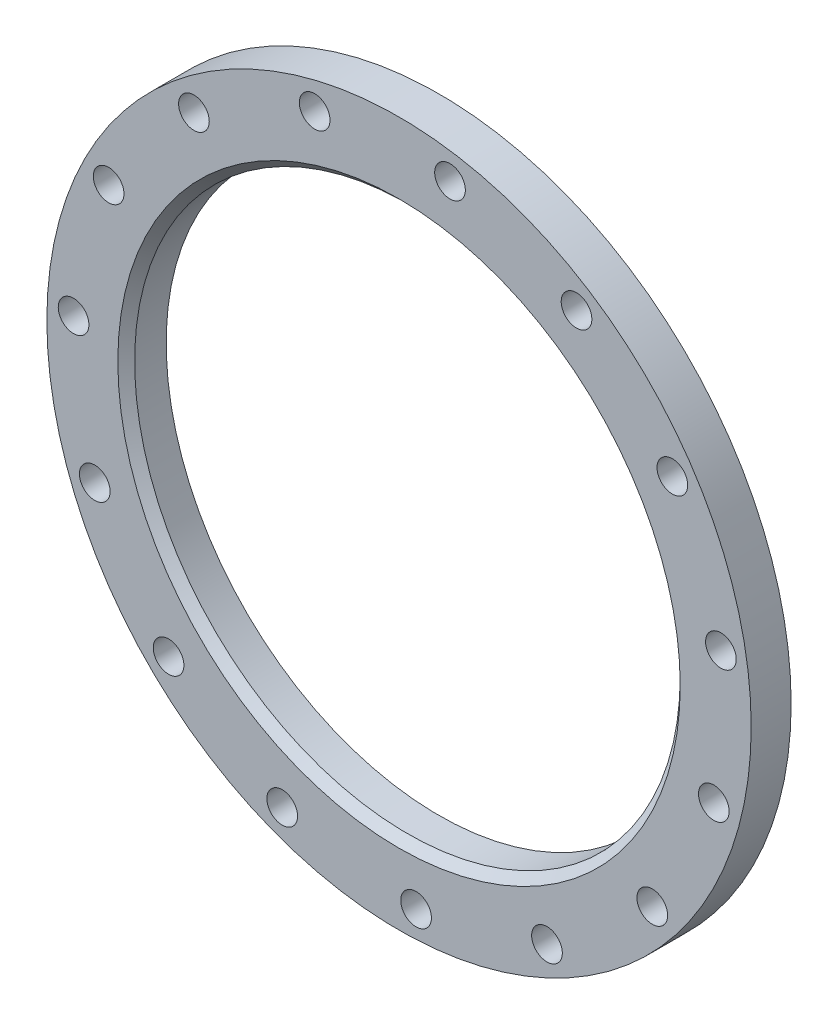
ISO-10303-21;
HEADER;
FILE_DESCRIPTION(('STEP AP214'),'2;1');
FILE_NAME('part.step','',(''),(''),'','','');
FILE_SCHEMA(('AUTOMOTIVE_DESIGN { 1 0 10303 214 1 1 1 1 }'));
ENDSEC;
DATA;
#1=APPLICATION_CONTEXT('core data for automotive mechanical design processes');
#2=APPLICATION_PROTOCOL_DEFINITION('international standard','automotive_design',2000,#1);
#3=PRODUCT_CONTEXT('',#1,'mechanical');
#4=PRODUCT('Part','Part','',(#3));
#5=PRODUCT_RELATED_PRODUCT_CATEGORY('part','',(#4));
#6=PRODUCT_DEFINITION_FORMATION('','',#4);
#7=PRODUCT_DEFINITION_CONTEXT('part definition',#1,'design');
#8=PRODUCT_DEFINITION('design','',#6,#7);
#9=PRODUCT_DEFINITION_SHAPE('','',#8);
#10=(LENGTH_UNIT() NAMED_UNIT(*) SI_UNIT(.MILLI.,.METRE.));
#11=(NAMED_UNIT(*) PLANE_ANGLE_UNIT() SI_UNIT($,.RADIAN.));
#12=(NAMED_UNIT(*) SI_UNIT($,.STERADIAN.) SOLID_ANGLE_UNIT());
#13=UNCERTAINTY_MEASURE_WITH_UNIT(LENGTH_MEASURE(1.E-05),#10,'distance_accuracy_value','');
#14=(GEOMETRIC_REPRESENTATION_CONTEXT(3) GLOBAL_UNCERTAINTY_ASSIGNED_CONTEXT((#13)) GLOBAL_UNIT_ASSIGNED_CONTEXT((#10,
#11,#12)) REPRESENTATION_CONTEXT('',''));
#15=CARTESIAN_POINT('',(0.,0.,0.));
#16=DIRECTION('',(0.,0.,1.));
#17=DIRECTION('',(1.,0.,0.));
#18=AXIS2_PLACEMENT_3D('',#15,#16,#17);
#19=CARTESIAN_POINT('',(0.,0.,38.));
#20=DIRECTION('',(0.,0.,1.));
#21=DIRECTION('',(1.,0.,0.));
#22=AXIS2_PLACEMENT_3D('',#19,#20,#21);
#23=PLANE('',#22);
#24=CARTESIAN_POINT('',(-80.2339039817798,299.437006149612,38.));
#25=DIRECTION('',(0.,0.,1.));
#26=DIRECTION('',(0.913545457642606,0.406736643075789,0.));
#27=AXIS2_PLACEMENT_3D('',#24,#25,#26);
#28=CIRCLE('',#27,14.587474);
#29=CARTESIAN_POINT('',(-66.9075833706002,305.370266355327,38.));
#30=VERTEX_POINT('',#29);
#31=EDGE_CURVE('E153',#30,#30,#28,.T.);
#32=ORIENTED_EDGE('',*,*,#31,.F.);
#33=EDGE_LOOP('',(#32));
#34=FACE_BOUND('',#33,.T.);
#35=CARTESIAN_POINT('',(-195.089321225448,240.915248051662,38.));
#36=DIRECTION('',(0.,0.,1.));
#37=DIRECTION('',(0.669130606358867,0.743144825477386,0.));
#38=AXIS2_PLACEMENT_3D('',#35,#36,#37);
#39=CIRCLE('',#38,14.587474);
#40=CARTESIAN_POINT('',(-185.328395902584,251.755853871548,38.));
#41=VERTEX_POINT('',#40);
#42=EDGE_CURVE('E150',#41,#41,#39,.T.);
#43=ORIENTED_EDGE('',*,*,#42,.F.);
#44=EDGE_LOOP('',(#43));
#45=FACE_BOUND('',#44,.T.);
#46=CARTESIAN_POINT('',(-276.212022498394,140.737054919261,38.));
#47=DIRECTION('',(0.,0.,1.));
#48=DIRECTION('',(0.309016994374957,0.95105651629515,0.));
#49=AXIS2_PLACEMENT_3D('',#46,#47,#48);
#50=CIRCLE('',#49,14.587474);
#51=CARTESIAN_POINT('',(-271.704245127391,154.610567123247,38.));
#52=VERTEX_POINT('',#51);
#53=EDGE_CURVE('E143',#52,#52,#50,.T.);
#54=ORIENTED_EDGE('',*,*,#53,.F.);
#55=EDGE_LOOP('',(#54));
#56=FACE_BOUND('',#55,.T.);
#57=CARTESIAN_POINT('',(-309.575155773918,16.2241464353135,38.));
#58=DIRECTION('',(0.,0.,1.));
#59=DIRECTION('',(-0.104528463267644,0.994521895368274,0.));
#60=AXIS2_PLACEMENT_3D('',#57,#58,#59);
#61=CIRCLE('',#60,14.587474);
#62=CARTESIAN_POINT('',(-311.099962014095,30.7317087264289,38.));
#63=VERTEX_POINT('',#62);
#64=EDGE_CURVE('E132',#63,#63,#61,.T.);
#65=ORIENTED_EDGE('',*,*,#64,.F.);
#66=EDGE_LOOP('',(#65));
#67=FACE_BOUND('',#66,.T.);
#68=CARTESIAN_POINT('',(-289.409932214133,-111.094064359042,38.));
#69=DIRECTION('',(0.,0.,1.));
#70=DIRECTION('',(-0.499999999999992,0.866025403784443,0.));
#71=AXIS2_PLACEMENT_3D('',#68,#69,#70);
#72=CIRCLE('',#71,14.587474);
#73=CARTESIAN_POINT('',(-296.703669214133,-98.4609412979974,38.));
#74=VERTEX_POINT('',#73);
#75=EDGE_CURVE('E129',#74,#74,#72,.T.);
#76=ORIENTED_EDGE('',*,*,#75,.F.);
#77=EDGE_LOOP('',(#76));
#78=FACE_BOUND('',#77,.T.);
#79=CARTESIAN_POINT('',(-219.20310216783,-219.20310216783,38.));
#80=DIRECTION('',(0.,0.,1.));
#81=DIRECTION('',(-0.809016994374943,0.58778525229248,0.));
#82=AXIS2_PLACEMENT_3D('',#79,#80,#81);
#83=CIRCLE('',#82,14.587474);
#84=CARTESIAN_POINT('',(-231.004616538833,-210.62880008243,38.));
#85=VERTEX_POINT('',#84);
#86=EDGE_CURVE('E122',#85,#85,#83,.T.);
#87=ORIENTED_EDGE('',*,*,#86,.F.);
#88=EDGE_LOOP('',(#87));
#89=FACE_BOUND('',#88,.T.);
#90=CARTESIAN_POINT('',(-111.094064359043,-289.409932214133,38.));
#91=DIRECTION('',(0.,0.,1.));
#92=DIRECTION('',(-0.978147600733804,0.207911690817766,0.));
#93=AXIS2_PLACEMENT_3D('',#90,#91,#92);
#94=CIRCLE('',#93,14.587474);
#95=CARTESIAN_POINT('',(-125.36276705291,-286.377025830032,38.));
#96=VERTEX_POINT('',#95);
#97=EDGE_CURVE('E119',#96,#96,#94,.T.);
#98=ORIENTED_EDGE('',*,*,#97,.F.);
#99=EDGE_LOOP('',(#98));
#100=FACE_BOUND('',#99,.T.);
#101=CARTESIAN_POINT('',(16.2241464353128,-309.575155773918,38.));
#102=DIRECTION('',(0.,0.,1.));
#103=DIRECTION('',(-0.978147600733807,-0.207911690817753,0.));
#104=AXIS2_PLACEMENT_3D('',#101,#102,#103);
#105=CIRCLE('',#104,14.587474);
#106=CARTESIAN_POINT('',(1.95544374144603,-312.608062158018,38.));
#107=VERTEX_POINT('',#106);
#108=EDGE_CURVE('E112',#107,#107,#105,.T.);
#109=ORIENTED_EDGE('',*,*,#108,.F.);
#110=EDGE_LOOP('',(#109));
#111=FACE_BOUND('',#110,.T.);
#112=CARTESIAN_POINT('',(140.73705491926,-276.212022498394,38.));
#113=DIRECTION('',(0.,0.,1.));
#114=DIRECTION('',(-0.80901699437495,-0.587785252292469,0.));
#115=AXIS2_PLACEMENT_3D('',#112,#113,#114);
#116=CIRCLE('',#115,14.587474);
#117=CARTESIAN_POINT('',(128.935540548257,-284.786324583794,38.));
#118=VERTEX_POINT('',#117);
#119=EDGE_CURVE('E104',#118,#118,#116,.T.);
#120=ORIENTED_EDGE('',*,*,#119,.F.);
#121=EDGE_LOOP('',(#120));
#122=FACE_BOUND('',#121,.T.);
#123=CARTESIAN_POINT('',(240.915248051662,-195.089321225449,38.));
#124=DIRECTION('',(0.,0.,1.));
#125=DIRECTION('',(-0.500000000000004,-0.866025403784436,0.));
#126=AXIS2_PLACEMENT_3D('',#123,#124,#125);
#127=CIRCLE('',#126,14.587474);
#128=CARTESIAN_POINT('',(233.621511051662,-207.722444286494,38.));
#129=VERTEX_POINT('',#128);
#130=EDGE_CURVE('E97',#129,#129,#127,.T.);
#131=ORIENTED_EDGE('',*,*,#130,.F.);
#132=EDGE_LOOP('',(#131));
#133=FACE_BOUND('',#132,.T.);
#134=CARTESIAN_POINT('',(299.437006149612,-80.2339039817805,38.));
#135=DIRECTION('',(0.,0.,1.));
#136=DIRECTION('',(-0.104528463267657,-0.994521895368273,0.));
#137=AXIS2_PLACEMENT_3D('',#134,#135,#136);
#138=CIRCLE('',#137,14.587474);
#139=CARTESIAN_POINT('',(297.912199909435,-94.7414662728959,38.));
#140=VERTEX_POINT('',#139);
#141=EDGE_CURVE('E91',#140,#140,#138,.T.);
#142=ORIENTED_EDGE('',*,*,#141,.F.);
#143=EDGE_LOOP('',(#142));
#144=FACE_BOUND('',#143,.T.);
#145=CARTESIAN_POINT('',(306.183385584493,48.4946841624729,38.));
#146=DIRECTION('',(0.,0.,1.));
#147=DIRECTION('',(0.309016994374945,-0.951056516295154,0.));
#148=AXIS2_PLACEMENT_3D('',#145,#146,#147);
#149=CIRCLE('',#148,14.587474);
#150=CARTESIAN_POINT('',(310.691162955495,34.6211719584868,38.));
#151=VERTEX_POINT('',#150);
#152=EDGE_CURVE('E87',#151,#151,#149,.T.);
#153=ORIENTED_EDGE('',*,*,#152,.F.);
#154=EDGE_LOOP('',(#153));
#155=FACE_BOUND('',#154,.T.);
#156=CARTESIAN_POINT('',(259.987876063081,168.83810085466,38.));
#157=DIRECTION('',(0.,0.,1.));
#158=DIRECTION('',(0.669130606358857,-0.743144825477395,0.));
#159=AXIS2_PLACEMENT_3D('',#156,#157,#158);
#160=CIRCLE('',#159,14.587474);
#161=CARTESIAN_POINT('',(269.748801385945,157.997495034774,38.));
#162=VERTEX_POINT('',#161);
#163=EDGE_CURVE('E81',#162,#162,#160,.T.);
#164=ORIENTED_EDGE('',*,*,#163,.F.);
#165=EDGE_LOOP('',(#164));
#166=FACE_BOUND('',#165,.T.);
#167=CARTESIAN_POINT('',(168.838100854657,259.987876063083,38.));
#168=DIRECTION('',(0.,0.,1.));
#169=DIRECTION('',(0.913545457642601,-0.406736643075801,0.));
#170=AXIS2_PLACEMENT_3D('',#167,#168,#169);
#171=CIRCLE('',#170,14.587474);
#172=CARTESIAN_POINT('',(182.164421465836,254.054615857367,38.));
#173=VERTEX_POINT('',#172);
#174=EDGE_CURVE('E73',#173,#173,#171,.T.);
#175=ORIENTED_EDGE('',*,*,#174,.F.);
#176=EDGE_LOOP('',(#175));
#177=FACE_BOUND('',#176,.T.);
#178=CARTESIAN_POINT('',(48.4946841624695,306.183385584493,38.));
#179=DIRECTION('',(0.,0.,1.));
#180=DIRECTION('',(1.,0.,0.));
#181=AXIS2_PLACEMENT_3D('',#178,#179,#180);
#182=CIRCLE('',#181,14.587474);
#183=CARTESIAN_POINT('',(63.0821581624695,306.183385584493,38.));
#184=VERTEX_POINT('',#183);
#185=EDGE_CURVE('E70',#184,#184,#182,.T.);
#186=ORIENTED_EDGE('',*,*,#185,.F.);
#187=EDGE_LOOP('',(#186));
#188=FACE_BOUND('',#187,.T.);
#189=CARTESIAN_POINT('',(0.,0.,38.));
#190=DIRECTION('',(0.,0.,1.));
#191=DIRECTION('',(1.,0.,0.));
#192=AXIS2_PLACEMENT_3D('',#189,#190,#191);
#193=CIRCLE('',#192,267.500000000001);
#194=CARTESIAN_POINT('',(267.500000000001,0.,38.));
#195=VERTEX_POINT('',#194);
#196=EDGE_CURVE('E10',#195,#195,#193,.F.);
#197=ORIENTED_EDGE('',*,*,#196,.T.);
#198=EDGE_LOOP('',(#197));
#199=FACE_BOUND('',#198,.T.);
#200=CARTESIAN_POINT('',(0.,0.,38.));
#201=DIRECTION('',(0.,0.,1.));
#202=DIRECTION('',(1.,0.,0.));
#203=AXIS2_PLACEMENT_3D('',#200,#201,#202);
#204=CIRCLE('',#203,335.);
#205=CARTESIAN_POINT('',(335.,0.,38.));
#206=VERTEX_POINT('',#205);
#207=EDGE_CURVE('E57',#206,#206,#204,.T.);
#208=ORIENTED_EDGE('',*,*,#207,.T.);
#209=EDGE_LOOP('',(#208));
#210=FACE_BOUND('',#209,.T.);
#211=ADVANCED_FACE('F44',(#34,#45,#56,#67,#78,#89,#100,#111,#122,#133,#144,#155,#166,#177,#188,
#199,#210),#23,.T.);
#212=CARTESIAN_POINT('',(0.,0.,0.));
#213=DIRECTION('',(0.,0.,1.));
#214=DIRECTION('',(1.,0.,0.));
#215=AXIS2_PLACEMENT_3D('',#212,#213,#214);
#216=PLANE('',#215);
#217=CARTESIAN_POINT('',(-80.2339039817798,299.437006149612,0.));
#218=DIRECTION('',(0.,0.,1.));
#219=DIRECTION('',(0.913545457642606,0.406736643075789,0.));
#220=AXIS2_PLACEMENT_3D('',#217,#218,#219);
#221=CIRCLE('',#220,14.587474);
#222=CARTESIAN_POINT('',(-66.9075833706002,305.370266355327,0.));
#223=VERTEX_POINT('',#222);
#224=EDGE_CURVE('E147',#223,#223,#221,.T.);
#225=ORIENTED_EDGE('',*,*,#224,.T.);
#226=EDGE_LOOP('',(#225));
#227=FACE_BOUND('',#226,.T.);
#228=CARTESIAN_POINT('',(-195.089321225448,240.915248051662,0.));
#229=DIRECTION('',(0.,0.,1.));
#230=DIRECTION('',(0.669130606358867,0.743144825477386,0.));
#231=AXIS2_PLACEMENT_3D('',#228,#229,#230);
#232=CIRCLE('',#231,14.587474);
#233=CARTESIAN_POINT('',(-185.328395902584,251.755853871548,0.));
#234=VERTEX_POINT('',#233);
#235=EDGE_CURVE('E145',#234,#234,#232,.T.);
#236=ORIENTED_EDGE('',*,*,#235,.T.);
#237=EDGE_LOOP('',(#236));
#238=FACE_BOUND('',#237,.T.);
#239=CARTESIAN_POINT('',(-276.212022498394,140.737054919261,0.));
#240=DIRECTION('',(0.,0.,1.));
#241=DIRECTION('',(0.309016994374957,0.95105651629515,0.));
#242=AXIS2_PLACEMENT_3D('',#239,#240,#241);
#243=CIRCLE('',#242,14.587474);
#244=CARTESIAN_POINT('',(-271.704245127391,154.610567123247,0.));
#245=VERTEX_POINT('',#244);
#246=EDGE_CURVE('E138',#245,#245,#243,.T.);
#247=ORIENTED_EDGE('',*,*,#246,.T.);
#248=EDGE_LOOP('',(#247));
#249=FACE_BOUND('',#248,.T.);
#250=CARTESIAN_POINT('',(-309.575155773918,16.2241464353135,0.));
#251=DIRECTION('',(0.,0.,1.));
#252=DIRECTION('',(-0.104528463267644,0.994521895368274,0.));
#253=AXIS2_PLACEMENT_3D('',#250,#251,#252);
#254=CIRCLE('',#253,14.587474);
#255=CARTESIAN_POINT('',(-311.099962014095,30.7317087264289,0.));
#256=VERTEX_POINT('',#255);
#257=EDGE_CURVE('E135',#256,#256,#254,.T.);
#258=ORIENTED_EDGE('',*,*,#257,.T.);
#259=EDGE_LOOP('',(#258));
#260=FACE_BOUND('',#259,.T.);
#261=CARTESIAN_POINT('',(-289.409932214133,-111.094064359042,0.));
#262=DIRECTION('',(0.,0.,1.));
#263=DIRECTION('',(-0.499999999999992,0.866025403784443,0.));
#264=AXIS2_PLACEMENT_3D('',#261,#262,#263);
#265=CIRCLE('',#264,14.587474);
#266=CARTESIAN_POINT('',(-296.703669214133,-98.4609412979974,0.));
#267=VERTEX_POINT('',#266);
#268=EDGE_CURVE('E127',#267,#267,#265,.T.);
#269=ORIENTED_EDGE('',*,*,#268,.T.);
#270=EDGE_LOOP('',(#269));
#271=FACE_BOUND('',#270,.T.);
#272=CARTESIAN_POINT('',(-219.20310216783,-219.20310216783,0.));
#273=DIRECTION('',(0.,0.,1.));
#274=DIRECTION('',(-0.809016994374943,0.58778525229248,0.));
#275=AXIS2_PLACEMENT_3D('',#272,#273,#274);
#276=CIRCLE('',#275,14.587474);
#277=CARTESIAN_POINT('',(-231.004616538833,-210.62880008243,0.));
#278=VERTEX_POINT('',#277);
#279=EDGE_CURVE('E118',#278,#278,#276,.T.);
#280=ORIENTED_EDGE('',*,*,#279,.T.);
#281=EDGE_LOOP('',(#280));
#282=FACE_BOUND('',#281,.T.);
#283=CARTESIAN_POINT('',(-111.094064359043,-289.409932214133,0.));
#284=DIRECTION('',(0.,0.,1.));
#285=DIRECTION('',(-0.978147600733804,0.207911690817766,0.));
#286=AXIS2_PLACEMENT_3D('',#283,#284,#285);
#287=CIRCLE('',#286,14.587474);
#288=CARTESIAN_POINT('',(-125.36276705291,-286.377025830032,0.));
#289=VERTEX_POINT('',#288);
#290=EDGE_CURVE('E111',#289,#289,#287,.T.);
#291=ORIENTED_EDGE('',*,*,#290,.T.);
#292=EDGE_LOOP('',(#291));
#293=FACE_BOUND('',#292,.T.);
#294=CARTESIAN_POINT('',(16.2241464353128,-309.575155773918,0.));
#295=DIRECTION('',(0.,0.,1.));
#296=DIRECTION('',(-0.978147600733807,-0.207911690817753,0.));
#297=AXIS2_PLACEMENT_3D('',#294,#295,#296);
#298=CIRCLE('',#297,14.587474);
#299=CARTESIAN_POINT('',(1.95544374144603,-312.608062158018,0.));
#300=VERTEX_POINT('',#299);
#301=EDGE_CURVE('E107',#300,#300,#298,.T.);
#302=ORIENTED_EDGE('',*,*,#301,.T.);
#303=EDGE_LOOP('',(#302));
#304=FACE_BOUND('',#303,.T.);
#305=CARTESIAN_POINT('',(140.73705491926,-276.212022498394,0.));
#306=DIRECTION('',(0.,0.,1.));
#307=DIRECTION('',(-0.80901699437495,-0.587785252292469,0.));
#308=AXIS2_PLACEMENT_3D('',#305,#306,#307);
#309=CIRCLE('',#308,14.587474);
#310=CARTESIAN_POINT('',(128.935540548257,-284.786324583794,0.));
#311=VERTEX_POINT('',#310);
#312=EDGE_CURVE('E105',#311,#311,#309,.T.);
#313=ORIENTED_EDGE('',*,*,#312,.T.);
#314=EDGE_LOOP('',(#313));
#315=FACE_BOUND('',#314,.T.);
#316=CARTESIAN_POINT('',(240.915248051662,-195.089321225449,0.));
#317=DIRECTION('',(0.,0.,1.));
#318=DIRECTION('',(-0.500000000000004,-0.866025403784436,0.));
#319=AXIS2_PLACEMENT_3D('',#316,#317,#318);
#320=CIRCLE('',#319,14.587474);
#321=CARTESIAN_POINT('',(233.621511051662,-207.722444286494,0.));
#322=VERTEX_POINT('',#321);
#323=EDGE_CURVE('E96',#322,#322,#320,.T.);
#324=ORIENTED_EDGE('',*,*,#323,.T.);
#325=EDGE_LOOP('',(#324));
#326=FACE_BOUND('',#325,.T.);
#327=CARTESIAN_POINT('',(299.437006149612,-80.2339039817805,0.));
#328=DIRECTION('',(0.,0.,1.));
#329=DIRECTION('',(-0.104528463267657,-0.994521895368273,0.));
#330=AXIS2_PLACEMENT_3D('',#327,#328,#329);
#331=CIRCLE('',#330,14.587474);
#332=CARTESIAN_POINT('',(297.912199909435,-94.7414662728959,0.));
#333=VERTEX_POINT('',#332);
#334=EDGE_CURVE('E89',#333,#333,#331,.T.);
#335=ORIENTED_EDGE('',*,*,#334,.T.);
#336=EDGE_LOOP('',(#335));
#337=FACE_BOUND('',#336,.T.);
#338=CARTESIAN_POINT('',(306.183385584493,48.4946841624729,0.));
#339=DIRECTION('',(0.,0.,1.));
#340=DIRECTION('',(0.309016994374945,-0.951056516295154,0.));
#341=AXIS2_PLACEMENT_3D('',#338,#339,#340);
#342=CIRCLE('',#341,14.587474);
#343=CARTESIAN_POINT('',(310.691162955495,34.6211719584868,0.));
#344=VERTEX_POINT('',#343);
#345=EDGE_CURVE('E82',#344,#344,#342,.T.);
#346=ORIENTED_EDGE('',*,*,#345,.T.);
#347=EDGE_LOOP('',(#346));
#348=FACE_BOUND('',#347,.T.);
#349=CARTESIAN_POINT('',(259.987876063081,168.83810085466,0.));
#350=DIRECTION('',(0.,0.,1.));
#351=DIRECTION('',(0.669130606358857,-0.743144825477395,0.));
#352=AXIS2_PLACEMENT_3D('',#349,#350,#351);
#353=CIRCLE('',#352,14.587474);
#354=CARTESIAN_POINT('',(269.748801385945,157.997495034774,0.));
#355=VERTEX_POINT('',#354);
#356=EDGE_CURVE('E76',#355,#355,#353,.T.);
#357=ORIENTED_EDGE('',*,*,#356,.T.);
#358=EDGE_LOOP('',(#357));
#359=FACE_BOUND('',#358,.T.);
#360=CARTESIAN_POINT('',(168.838100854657,259.987876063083,0.));
#361=DIRECTION('',(0.,0.,1.));
#362=DIRECTION('',(0.913545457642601,-0.406736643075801,0.));
#363=AXIS2_PLACEMENT_3D('',#360,#361,#362);
#364=CIRCLE('',#363,14.587474);
#365=CARTESIAN_POINT('',(182.164421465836,254.054615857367,0.));
#366=VERTEX_POINT('',#365);
#367=EDGE_CURVE('E75',#366,#366,#364,.T.);
#368=ORIENTED_EDGE('',*,*,#367,.T.);
#369=EDGE_LOOP('',(#368));
#370=FACE_BOUND('',#369,.T.);
#371=CARTESIAN_POINT('',(48.4946841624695,306.183385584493,0.));
#372=DIRECTION('',(0.,0.,1.));
#373=DIRECTION('',(1.,0.,0.));
#374=AXIS2_PLACEMENT_3D('',#371,#372,#373);
#375=CIRCLE('',#374,14.587474);
#376=CARTESIAN_POINT('',(63.0821581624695,306.183385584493,0.));
#377=VERTEX_POINT('',#376);
#378=EDGE_CURVE('E67',#377,#377,#375,.T.);
#379=ORIENTED_EDGE('',*,*,#378,.T.);
#380=EDGE_LOOP('',(#379));
#381=FACE_BOUND('',#380,.T.);
#382=CARTESIAN_POINT('',(0.,0.,0.));
#383=DIRECTION('',(0.,0.,1.));
#384=DIRECTION('',(1.,0.,0.));
#385=AXIS2_PLACEMENT_3D('',#382,#383,#384);
#386=CIRCLE('',#385,335.);
#387=CARTESIAN_POINT('',(335.,0.,0.));
#388=VERTEX_POINT('',#387);
#389=EDGE_CURVE('E58',#388,#388,#386,.T.);
#390=ORIENTED_EDGE('',*,*,#389,.F.);
#391=EDGE_LOOP('',(#390));
#392=FACE_BOUND('',#391,.T.);
#393=CARTESIAN_POINT('',(0.,0.,0.));
#394=DIRECTION('',(0.,0.,1.));
#395=DIRECTION('',(1.,0.,0.));
#396=AXIS2_PLACEMENT_3D('',#393,#394,#395);
#397=CIRCLE('',#396,259.5);
#398=CARTESIAN_POINT('',(259.5,0.,0.));
#399=VERTEX_POINT('',#398);
#400=EDGE_CURVE('E61',#399,#399,#397,.T.);
#401=ORIENTED_EDGE('',*,*,#400,.T.);
#402=EDGE_LOOP('',(#401));
#403=FACE_BOUND('',#402,.T.);
#404=ADVANCED_FACE('F157',(#227,#238,#249,#260,#271,#282,#293,#304,#315,#326,#337,#348,#359,
#370,#381,#392,#403),#216,.F.);
#405=CARTESIAN_POINT('',(0.,0.,38.));
#406=DIRECTION('',(0.,0.,-1.));
#407=DIRECTION('',(-1.,0.,0.));
#408=AXIS2_PLACEMENT_3D('',#405,#406,#407);
#409=CYLINDRICAL_SURFACE('',#408,335.);
#410=ORIENTED_EDGE('',*,*,#207,.F.);
#411=EDGE_LOOP('',(#410));
#412=FACE_BOUND('',#411,.T.);
#413=ORIENTED_EDGE('',*,*,#389,.T.);
#414=EDGE_LOOP('',(#413));
#415=FACE_BOUND('',#414,.T.);
#416=ADVANCED_FACE('F205',(#412,#415),#409,.T.);
#417=CARTESIAN_POINT('',(0.,0.,38.));
#418=DIRECTION('',(0.,0.,-1.));
#419=DIRECTION('',(-1.,0.,0.));
#420=AXIS2_PLACEMENT_3D('',#417,#418,#419);
#421=CYLINDRICAL_SURFACE('',#420,259.5);
#422=CARTESIAN_POINT('',(0.,0.,29.9999999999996));
#423=DIRECTION('',(0.,0.,1.));
#424=DIRECTION('',(1.,0.,0.));
#425=AXIS2_PLACEMENT_3D('',#422,#423,#424);
#426=CIRCLE('',#425,259.5);
#427=CARTESIAN_POINT('',(259.5,0.,29.9999999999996));
#428=VERTEX_POINT('',#427);
#429=EDGE_CURVE('E55',#428,#428,#426,.T.);
#430=ORIENTED_EDGE('',*,*,#429,.T.);
#431=EDGE_LOOP('',(#430));
#432=FACE_BOUND('',#431,.T.);
#433=ORIENTED_EDGE('',*,*,#400,.F.);
#434=EDGE_LOOP('',(#433));
#435=FACE_BOUND('',#434,.T.);
#436=ADVANCED_FACE('F202',(#432,#435),#421,.F.);
#437=CARTESIAN_POINT('',(0.,0.,29.9999999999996));
#438=DIRECTION('',(0.,0.,1.));
#439=DIRECTION('',(1.,0.,0.));
#440=AXIS2_PLACEMENT_3D('',#437,#438,#439);
#441=CONICAL_SURFACE('',#440,259.5,0.785398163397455);
#442=ORIENTED_EDGE('',*,*,#196,.F.);
#443=EDGE_LOOP('',(#442));
#444=FACE_BOUND('',#443,.T.);
#445=ORIENTED_EDGE('',*,*,#429,.F.);
#446=EDGE_LOOP('',(#445));
#447=FACE_BOUND('',#446,.T.);
#448=ADVANCED_FACE('F50',(#444,#447),#441,.F.);
#449=CARTESIAN_POINT('',(48.4946841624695,306.183385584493,0.));
#450=DIRECTION('',(0.,0.,1.));
#451=DIRECTION('',(1.,0.,0.));
#452=AXIS2_PLACEMENT_3D('',#449,#450,#451);
#453=CYLINDRICAL_SURFACE('',#452,14.587474);
#454=ORIENTED_EDGE('',*,*,#378,.F.);
#455=EDGE_LOOP('',(#454));
#456=FACE_BOUND('',#455,.T.);
#457=ORIENTED_EDGE('',*,*,#185,.T.);
#458=EDGE_LOOP('',(#457));
#459=FACE_BOUND('',#458,.T.);
#460=ADVANCED_FACE('F217',(#456,#459),#453,.F.);
#461=CARTESIAN_POINT('',(168.838100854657,259.987876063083,0.));
#462=DIRECTION('',(0.,0.,1.));
#463=DIRECTION('',(1.,0.,0.));
#464=AXIS2_PLACEMENT_3D('',#461,#462,#463);
#465=CYLINDRICAL_SURFACE('',#464,14.587474);
#466=ORIENTED_EDGE('',*,*,#367,.F.);
#467=EDGE_LOOP('',(#466));
#468=FACE_BOUND('',#467,.T.);
#469=ORIENTED_EDGE('',*,*,#174,.T.);
#470=EDGE_LOOP('',(#469));
#471=FACE_BOUND('',#470,.T.);
#472=ADVANCED_FACE('F224',(#468,#471),#465,.F.);
#473=CARTESIAN_POINT('',(259.987876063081,168.83810085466,0.));
#474=DIRECTION('',(0.,0.,1.));
#475=DIRECTION('',(1.,0.,0.));
#476=AXIS2_PLACEMENT_3D('',#473,#474,#475);
#477=CYLINDRICAL_SURFACE('',#476,14.587474);
#478=ORIENTED_EDGE('',*,*,#356,.F.);
#479=EDGE_LOOP('',(#478));
#480=FACE_BOUND('',#479,.T.);
#481=ORIENTED_EDGE('',*,*,#163,.T.);
#482=EDGE_LOOP('',(#481));
#483=FACE_BOUND('',#482,.T.);
#484=ADVANCED_FACE('F229',(#480,#483),#477,.F.);
#485=CARTESIAN_POINT('',(306.183385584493,48.4946841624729,0.));
#486=DIRECTION('',(0.,0.,1.));
#487=DIRECTION('',(1.,0.,0.));
#488=AXIS2_PLACEMENT_3D('',#485,#486,#487);
#489=CYLINDRICAL_SURFACE('',#488,14.587474);
#490=ORIENTED_EDGE('',*,*,#345,.F.);
#491=EDGE_LOOP('',(#490));
#492=FACE_BOUND('',#491,.T.);
#493=ORIENTED_EDGE('',*,*,#152,.T.);
#494=EDGE_LOOP('',(#493));
#495=FACE_BOUND('',#494,.T.);
#496=ADVANCED_FACE('F233',(#492,#495),#489,.F.);
#497=CARTESIAN_POINT('',(299.437006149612,-80.2339039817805,0.));
#498=DIRECTION('',(0.,0.,1.));
#499=DIRECTION('',(1.,0.,0.));
#500=AXIS2_PLACEMENT_3D('',#497,#498,#499);
#501=CYLINDRICAL_SURFACE('',#500,14.587474);
#502=ORIENTED_EDGE('',*,*,#334,.F.);
#503=EDGE_LOOP('',(#502));
#504=FACE_BOUND('',#503,.T.);
#505=ORIENTED_EDGE('',*,*,#141,.T.);
#506=EDGE_LOOP('',(#505));
#507=FACE_BOUND('',#506,.T.);
#508=ADVANCED_FACE('F231',(#504,#507),#501,.F.);
#509=CARTESIAN_POINT('',(240.915248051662,-195.089321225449,0.));
#510=DIRECTION('',(0.,0.,1.));
#511=DIRECTION('',(1.,0.,0.));
#512=AXIS2_PLACEMENT_3D('',#509,#510,#511);
#513=CYLINDRICAL_SURFACE('',#512,14.587474);
#514=ORIENTED_EDGE('',*,*,#323,.F.);
#515=EDGE_LOOP('',(#514));
#516=FACE_BOUND('',#515,.T.);
#517=ORIENTED_EDGE('',*,*,#130,.T.);
#518=EDGE_LOOP('',(#517));
#519=FACE_BOUND('',#518,.T.);
#520=ADVANCED_FACE('F239',(#516,#519),#513,.F.);
#521=CARTESIAN_POINT('',(140.73705491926,-276.212022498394,0.));
#522=DIRECTION('',(0.,0.,1.));
#523=DIRECTION('',(1.,0.,0.));
#524=AXIS2_PLACEMENT_3D('',#521,#522,#523);
#525=CYLINDRICAL_SURFACE('',#524,14.587474);
#526=ORIENTED_EDGE('',*,*,#312,.F.);
#527=EDGE_LOOP('',(#526));
#528=FACE_BOUND('',#527,.T.);
#529=ORIENTED_EDGE('',*,*,#119,.T.);
#530=EDGE_LOOP('',(#529));
#531=FACE_BOUND('',#530,.T.);
#532=ADVANCED_FACE('F241',(#528,#531),#525,.F.);
#533=CARTESIAN_POINT('',(16.2241464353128,-309.575155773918,0.));
#534=DIRECTION('',(0.,0.,1.));
#535=DIRECTION('',(1.,0.,0.));
#536=AXIS2_PLACEMENT_3D('',#533,#534,#535);
#537=CYLINDRICAL_SURFACE('',#536,14.587474);
#538=ORIENTED_EDGE('',*,*,#301,.F.);
#539=EDGE_LOOP('',(#538));
#540=FACE_BOUND('',#539,.T.);
#541=ORIENTED_EDGE('',*,*,#108,.T.);
#542=EDGE_LOOP('',(#541));
#543=FACE_BOUND('',#542,.T.);
#544=ADVANCED_FACE('F250',(#540,#543),#537,.F.);
#545=CARTESIAN_POINT('',(-111.094064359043,-289.409932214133,0.));
#546=DIRECTION('',(0.,0.,1.));
#547=DIRECTION('',(1.,0.,0.));
#548=AXIS2_PLACEMENT_3D('',#545,#546,#547);
#549=CYLINDRICAL_SURFACE('',#548,14.587474);
#550=ORIENTED_EDGE('',*,*,#290,.F.);
#551=EDGE_LOOP('',(#550));
#552=FACE_BOUND('',#551,.T.);
#553=ORIENTED_EDGE('',*,*,#97,.T.);
#554=EDGE_LOOP('',(#553));
#555=FACE_BOUND('',#554,.T.);
#556=ADVANCED_FACE('F253',(#552,#555),#549,.F.);
#557=CARTESIAN_POINT('',(-219.20310216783,-219.20310216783,0.));
#558=DIRECTION('',(0.,0.,1.));
#559=DIRECTION('',(1.,0.,0.));
#560=AXIS2_PLACEMENT_3D('',#557,#558,#559);
#561=CYLINDRICAL_SURFACE('',#560,14.587474);
#562=ORIENTED_EDGE('',*,*,#279,.F.);
#563=EDGE_LOOP('',(#562));
#564=FACE_BOUND('',#563,.T.);
#565=ORIENTED_EDGE('',*,*,#86,.T.);
#566=EDGE_LOOP('',(#565));
#567=FACE_BOUND('',#566,.T.);
#568=ADVANCED_FACE('F254',(#564,#567),#561,.F.);
#569=CARTESIAN_POINT('',(-289.409932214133,-111.094064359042,0.));
#570=DIRECTION('',(0.,0.,1.));
#571=DIRECTION('',(1.,0.,0.));
#572=AXIS2_PLACEMENT_3D('',#569,#570,#571);
#573=CYLINDRICAL_SURFACE('',#572,14.587474);
#574=ORIENTED_EDGE('',*,*,#268,.F.);
#575=EDGE_LOOP('',(#574));
#576=FACE_BOUND('',#575,.T.);
#577=ORIENTED_EDGE('',*,*,#75,.T.);
#578=EDGE_LOOP('',(#577));
#579=FACE_BOUND('',#578,.T.);
#580=ADVANCED_FACE('F259',(#576,#579),#573,.F.);
#581=CARTESIAN_POINT('',(-309.575155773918,16.2241464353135,0.));
#582=DIRECTION('',(0.,0.,1.));
#583=DIRECTION('',(1.,0.,0.));
#584=AXIS2_PLACEMENT_3D('',#581,#582,#583);
#585=CYLINDRICAL_SURFACE('',#584,14.587474);
#586=ORIENTED_EDGE('',*,*,#257,.F.);
#587=EDGE_LOOP('',(#586));
#588=FACE_BOUND('',#587,.T.);
#589=ORIENTED_EDGE('',*,*,#64,.T.);
#590=EDGE_LOOP('',(#589));
#591=FACE_BOUND('',#590,.T.);
#592=ADVANCED_FACE('F263',(#588,#591),#585,.F.);
#593=CARTESIAN_POINT('',(-276.212022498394,140.737054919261,0.));
#594=DIRECTION('',(0.,0.,1.));
#595=DIRECTION('',(1.,0.,0.));
#596=AXIS2_PLACEMENT_3D('',#593,#594,#595);
#597=CYLINDRICAL_SURFACE('',#596,14.587474);
#598=ORIENTED_EDGE('',*,*,#246,.F.);
#599=EDGE_LOOP('',(#598));
#600=FACE_BOUND('',#599,.T.);
#601=ORIENTED_EDGE('',*,*,#53,.T.);
#602=EDGE_LOOP('',(#601));
#603=FACE_BOUND('',#602,.T.);
#604=ADVANCED_FACE('F270',(#600,#603),#597,.F.);
#605=CARTESIAN_POINT('',(-195.089321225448,240.915248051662,0.));
#606=DIRECTION('',(0.,0.,1.));
#607=DIRECTION('',(1.,0.,0.));
#608=AXIS2_PLACEMENT_3D('',#605,#606,#607);
#609=CYLINDRICAL_SURFACE('',#608,14.587474);
#610=ORIENTED_EDGE('',*,*,#235,.F.);
#611=EDGE_LOOP('',(#610));
#612=FACE_BOUND('',#611,.T.);
#613=ORIENTED_EDGE('',*,*,#42,.T.);
#614=EDGE_LOOP('',(#613));
#615=FACE_BOUND('',#614,.T.);
#616=ADVANCED_FACE('F164',(#612,#615),#609,.F.);
#617=CARTESIAN_POINT('',(-80.2339039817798,299.437006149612,0.));
#618=DIRECTION('',(0.,0.,1.));
#619=DIRECTION('',(1.,0.,0.));
#620=AXIS2_PLACEMENT_3D('',#617,#618,#619);
#621=CYLINDRICAL_SURFACE('',#620,14.587474);
#622=ORIENTED_EDGE('',*,*,#224,.F.);
#623=EDGE_LOOP('',(#622));
#624=FACE_BOUND('',#623,.T.);
#625=ORIENTED_EDGE('',*,*,#31,.T.);
#626=EDGE_LOOP('',(#625));
#627=FACE_BOUND('',#626,.T.);
#628=ADVANCED_FACE('F165',(#624,#627),#621,.F.);
#629=CLOSED_SHELL('',(#211,#404,#416,#436,#448,#460,#472,#484,#496,#508,#520,#532,#544,#556,
#568,#580,#592,#604,#616,#628));
#630=MANIFOLD_SOLID_BREP('B2',#629);
#631=ADVANCED_BREP_SHAPE_REPRESENTATION('',(#18,#630),#14);
#632=SHAPE_DEFINITION_REPRESENTATION(#9,#631);
ENDSEC;
END-ISO-10303-21;
